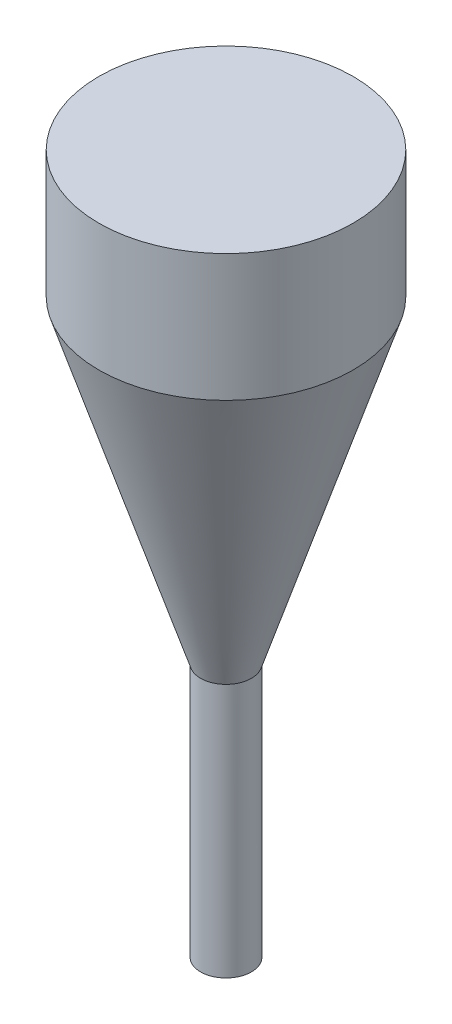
ISO-10303-21;
HEADER;
FILE_DESCRIPTION(('STEP AP214'),'2;1');
FILE_NAME('part.step','',(''),(''),'','','');
FILE_SCHEMA(('AUTOMOTIVE_DESIGN { 1 0 10303 214 1 1 1 1 }'));
ENDSEC;
DATA;
#1=APPLICATION_CONTEXT('core data for automotive mechanical design processes');
#2=APPLICATION_PROTOCOL_DEFINITION('international standard','automotive_design',2000,#1);
#3=PRODUCT_CONTEXT('',#1,'mechanical');
#4=PRODUCT('Part','Part','',(#3));
#5=PRODUCT_RELATED_PRODUCT_CATEGORY('part','',(#4));
#6=PRODUCT_DEFINITION_FORMATION('','',#4);
#7=PRODUCT_DEFINITION_CONTEXT('part definition',#1,'design');
#8=PRODUCT_DEFINITION('design','',#6,#7);
#9=PRODUCT_DEFINITION_SHAPE('','',#8);
#10=(LENGTH_UNIT() NAMED_UNIT(*) SI_UNIT(.MILLI.,.METRE.));
#11=(NAMED_UNIT(*) PLANE_ANGLE_UNIT() SI_UNIT($,.RADIAN.));
#12=(NAMED_UNIT(*) SI_UNIT($,.STERADIAN.) SOLID_ANGLE_UNIT());
#13=UNCERTAINTY_MEASURE_WITH_UNIT(LENGTH_MEASURE(1.E-05),#10,'distance_accuracy_value','');
#14=(GEOMETRIC_REPRESENTATION_CONTEXT(3) GLOBAL_UNCERTAINTY_ASSIGNED_CONTEXT((#13)) GLOBAL_UNIT_ASSIGNED_CONTEXT((#10,
#11,#12)) REPRESENTATION_CONTEXT('',''));
#15=CARTESIAN_POINT('',(0.,0.,0.));
#16=DIRECTION('',(0.,0.,1.));
#17=DIRECTION('',(1.,0.,0.));
#18=AXIS2_PLACEMENT_3D('',#15,#16,#17);
#19=CARTESIAN_POINT('',(0.,35.,0.));
#20=DIRECTION('',(0.,1.,0.));
#21=DIRECTION('',(0.,0.,1.));
#22=AXIS2_PLACEMENT_3D('',#19,#20,#21);
#23=PLANE('',#22);
#24=CARTESIAN_POINT('',(0.,35.,0.));
#25=DIRECTION('',(0.,-1.,0.));
#26=DIRECTION('',(0.,0.,-1.));
#27=AXIS2_PLACEMENT_3D('',#24,#25,#26);
#28=CIRCLE('',#27,10.);
#29=CARTESIAN_POINT('',(0.,35.,-10.));
#30=VERTEX_POINT('',#29);
#31=EDGE_CURVE('E10',#30,#30,#28,.T.);
#32=ORIENTED_EDGE('',*,*,#31,.F.);
#33=EDGE_LOOP('',(#32));
#34=FACE_BOUND('',#33,.T.);
#35=ADVANCED_FACE('F31',(#34),#23,.T.);
#36=CARTESIAN_POINT('',(0.,0.,0.));
#37=DIRECTION('',(0.,-1.,0.));
#38=DIRECTION('',(0.,0.,-1.));
#39=AXIS2_PLACEMENT_3D('',#36,#37,#38);
#40=CYLINDRICAL_SURFACE('',#39,10.);
#41=ORIENTED_EDGE('',*,*,#31,.T.);
#42=EDGE_LOOP('',(#41));
#43=FACE_BOUND('',#42,.T.);
#44=CARTESIAN_POINT('',(0.,25.,0.));
#45=DIRECTION('',(0.,-1.,0.));
#46=DIRECTION('',(0.,0.,-1.));
#47=AXIS2_PLACEMENT_3D('',#44,#45,#46);
#48=CIRCLE('',#47,10.);
#49=CARTESIAN_POINT('',(0.,25.,10.));
#50=VERTEX_POINT('',#49);
#51=EDGE_CURVE('E37',#50,#50,#48,.T.);
#52=ORIENTED_EDGE('',*,*,#51,.F.);
#53=EDGE_LOOP('',(#52));
#54=FACE_BOUND('',#53,.T.);
#55=ADVANCED_FACE('F61',(#43,#54),#40,.T.);
#56=CARTESIAN_POINT('',(0.,0.,0.));
#57=DIRECTION('',(0.,1.,0.));
#58=DIRECTION('',(0.,0.,1.));
#59=AXIS2_PLACEMENT_3D('',#56,#57,#58);
#60=CONICAL_SURFACE('',#59,2.,0.309702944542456);
#61=CARTESIAN_POINT('',(0.,0.,0.));
#62=DIRECTION('',(0.,-1.,0.));
#63=DIRECTION('',(0.,0.,-1.));
#64=AXIS2_PLACEMENT_3D('',#61,#62,#63);
#65=CIRCLE('',#64,2.);
#66=CARTESIAN_POINT('',(0.,0.,2.));
#67=VERTEX_POINT('',#66);
#68=EDGE_CURVE('E41',#67,#67,#65,.T.);
#69=CARTESIAN_POINT('',(0.,25.,10.));
#70=CARTESIAN_POINT('',(0.,24.7395833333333,9.91666666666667));
#71=CARTESIAN_POINT('',(0.,24.4791666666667,9.83333333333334));
#72=CARTESIAN_POINT('',(0.,23.9583333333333,9.66666666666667));
#73=CARTESIAN_POINT('',(0.,23.6979166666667,9.58333333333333));
#74=CARTESIAN_POINT('',(0.,23.1770833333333,9.41666666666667));
#75=CARTESIAN_POINT('',(0.,22.9166666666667,9.33333333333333));
#76=CARTESIAN_POINT('',(0.,22.3958333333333,9.16666666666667));
#77=CARTESIAN_POINT('',(0.,22.1354166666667,9.08333333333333));
#78=CARTESIAN_POINT('',(0.,21.6145833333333,8.91666666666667));
#79=CARTESIAN_POINT('',(0.,21.3541666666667,8.83333333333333));
#80=CARTESIAN_POINT('',(0.,20.8333333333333,8.66666666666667));
#81=CARTESIAN_POINT('',(0.,20.5729166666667,8.58333333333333));
#82=CARTESIAN_POINT('',(0.,20.0520833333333,8.41666666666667));
#83=CARTESIAN_POINT('',(0.,19.7916666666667,8.33333333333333));
#84=CARTESIAN_POINT('',(0.,19.2708333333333,8.16666666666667));
#85=CARTESIAN_POINT('',(0.,19.0104166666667,8.08333333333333));
#86=CARTESIAN_POINT('',(0.,18.4895833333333,7.91666666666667));
#87=CARTESIAN_POINT('',(0.,18.2291666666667,7.83333333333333));
#88=CARTESIAN_POINT('',(0.,17.7083333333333,7.66666666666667));
#89=CARTESIAN_POINT('',(0.,17.4479166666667,7.58333333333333));
#90=CARTESIAN_POINT('',(0.,16.9270833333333,7.41666666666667));
#91=CARTESIAN_POINT('',(0.,16.6666666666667,7.33333333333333));
#92=CARTESIAN_POINT('',(0.,16.1458333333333,7.16666666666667));
#93=CARTESIAN_POINT('',(0.,15.8854166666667,7.08333333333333));
#94=CARTESIAN_POINT('',(0.,15.3645833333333,6.91666666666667));
#95=CARTESIAN_POINT('',(0.,15.1041666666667,6.83333333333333));
#96=CARTESIAN_POINT('',(0.,14.5833333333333,6.66666666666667));
#97=CARTESIAN_POINT('',(0.,14.3229166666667,6.58333333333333));
#98=CARTESIAN_POINT('',(0.,13.8020833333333,6.41666666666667));
#99=CARTESIAN_POINT('',(0.,13.5416666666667,6.33333333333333));
#100=CARTESIAN_POINT('',(0.,13.0208333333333,6.16666666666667));
#101=CARTESIAN_POINT('',(0.,12.7604166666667,6.08333333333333));
#102=CARTESIAN_POINT('',(0.,12.2395833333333,5.91666666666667));
#103=CARTESIAN_POINT('',(0.,11.9791666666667,5.83333333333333));
#104=CARTESIAN_POINT('',(0.,11.4583333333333,5.66666666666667));
#105=CARTESIAN_POINT('',(0.,11.1979166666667,5.58333333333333));
#106=CARTESIAN_POINT('',(0.,10.6770833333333,5.41666666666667));
#107=CARTESIAN_POINT('',(0.,10.4166666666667,5.33333333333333));
#108=CARTESIAN_POINT('',(0.,9.89583333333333,5.16666666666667));
#109=CARTESIAN_POINT('',(0.,9.63541666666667,5.08333333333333));
#110=CARTESIAN_POINT('',(0.,9.11458333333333,4.91666666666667));
#111=CARTESIAN_POINT('',(0.,8.85416666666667,4.83333333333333));
#112=CARTESIAN_POINT('',(0.,8.33333333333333,4.66666666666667));
#113=CARTESIAN_POINT('',(0.,8.07291666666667,4.58333333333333));
#114=CARTESIAN_POINT('',(0.,7.55208333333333,4.41666666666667));
#115=CARTESIAN_POINT('',(0.,7.29166666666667,4.33333333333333));
#116=CARTESIAN_POINT('',(0.,6.77083333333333,4.16666666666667));
#117=CARTESIAN_POINT('',(0.,6.51041666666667,4.08333333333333));
#118=CARTESIAN_POINT('',(0.,5.98958333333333,3.91666666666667));
#119=CARTESIAN_POINT('',(0.,5.72916666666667,3.83333333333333));
#120=CARTESIAN_POINT('',(0.,5.20833333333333,3.66666666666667));
#121=CARTESIAN_POINT('',(0.,4.94791666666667,3.58333333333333));
#122=CARTESIAN_POINT('',(0.,4.42708333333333,3.41666666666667));
#123=CARTESIAN_POINT('',(0.,4.16666666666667,3.33333333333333));
#124=CARTESIAN_POINT('',(0.,3.64583333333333,3.16666666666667));
#125=CARTESIAN_POINT('',(0.,3.38541666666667,3.08333333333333));
#126=CARTESIAN_POINT('',(0.,2.86458333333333,2.91666666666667));
#127=CARTESIAN_POINT('',(0.,2.60416666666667,2.83333333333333));
#128=CARTESIAN_POINT('',(0.,2.08333333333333,2.66666666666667));
#129=CARTESIAN_POINT('',(0.,1.82291666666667,2.58333333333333));
#130=CARTESIAN_POINT('',(0.,1.30208333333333,2.41666666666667));
#131=CARTESIAN_POINT('',(0.,1.04166666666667,2.33333333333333));
#132=CARTESIAN_POINT('',(0.,0.520833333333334,2.16666666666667));
#133=CARTESIAN_POINT('',(0.,0.260416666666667,2.08333333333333));
#134=CARTESIAN_POINT('',(0.,0.,2.));
#135=B_SPLINE_CURVE_WITH_KNOTS('',3,(#69,#70,#71,#72,#73,#74,#75,#76,#77,#78,#79,#80,#81,#82,
#83,#84,#85,#86,#87,#88,#89,#90,#91,#92,#93,#94,#95,#96,#97,#98,#99,#100,#101,#102,#103,#104,
#105,#106,#107,#108,#109,#110,#111,#112,#113,#114,#115,#116,#117,#118,#119,#120,#121,#122,#123,
#124,#125,#126,#127,#128,#129,#130,#131,#132,#133,#134),.UNSPECIFIED.,.F.,.F.,(4,2,2,2,2,2,2,2,
2,2,2,2,2,2,2,2,2,2,2,2,2,2,2,2,2,2,2,2,2,2,2,2,4),(0.,0.820275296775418,1.64055059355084,
2.46082589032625,3.28110118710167,4.10137648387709,4.92165178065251,5.74192707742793,
6.56220237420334,7.38247767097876,8.20275296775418,9.0230282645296,9.84330356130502,
10.6635788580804,11.4838541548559,12.3041294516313,13.1244047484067,13.9446800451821,
14.7649553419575,15.5852306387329,16.4055059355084,17.2257812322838,18.0460565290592,
18.8663318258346,19.68660712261,20.5068824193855,21.3271577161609,22.1474330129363,
22.9677083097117,23.7879836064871,24.6082589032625,25.428534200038,26.2488094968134),.UNSPECIFIED.);
#136=EDGE_CURVE('BSEAM56',#50,#67,#135,.T.);
#137=ORIENTED_EDGE('',*,*,#51,.T.);
#138=ORIENTED_EDGE('',*,*,#68,.F.);
#139=ORIENTED_EDGE('',*,*,#136,.T.);
#140=ORIENTED_EDGE('',*,*,#136,.F.);
#141=EDGE_LOOP('',(#137,#139,#138,#140));
#142=FACE_BOUND('',#141,.T.);
#143=ADVANCED_FACE('F56',(#142),#60,.T.);
#144=CARTESIAN_POINT('',(0.,-20.,0.));
#145=DIRECTION('',(0.,1.,0.));
#146=DIRECTION('',(0.,0.,1.));
#147=AXIS2_PLACEMENT_3D('',#144,#145,#146);
#148=CYLINDRICAL_SURFACE('',#147,2.);
#149=CARTESIAN_POINT('',(0.,-20.,0.));
#150=DIRECTION('',(0.,-1.,0.));
#151=DIRECTION('',(0.,0.,-1.));
#152=AXIS2_PLACEMENT_3D('',#149,#150,#151);
#153=CIRCLE('',#152,2.);
#154=CARTESIAN_POINT('',(0.,-20.,-2.));
#155=VERTEX_POINT('',#154);
#156=EDGE_CURVE('E45',#155,#155,#153,.T.);
#157=ORIENTED_EDGE('',*,*,#156,.F.);
#158=EDGE_LOOP('',(#157));
#159=FACE_BOUND('',#158,.T.);
#160=ORIENTED_EDGE('',*,*,#68,.T.);
#161=EDGE_LOOP('',(#160));
#162=FACE_BOUND('',#161,.T.);
#163=ADVANCED_FACE('F53',(#159,#162),#148,.T.);
#164=CARTESIAN_POINT('',(0.,-20.,0.));
#165=DIRECTION('',(0.,-1.,0.));
#166=DIRECTION('',(0.,0.,-1.));
#167=AXIS2_PLACEMENT_3D('',#164,#165,#166);
#168=PLANE('',#167);
#169=ORIENTED_EDGE('',*,*,#156,.T.);
#170=EDGE_LOOP('',(#169));
#171=FACE_BOUND('',#170,.T.);
#172=ADVANCED_FACE('F51',(#171),#168,.T.);
#173=CLOSED_SHELL('',(#35,#55,#143,#163,#172));
#174=MANIFOLD_SOLID_BREP('B2',#173);
#175=ADVANCED_BREP_SHAPE_REPRESENTATION('',(#18,#174),#14);
#176=SHAPE_DEFINITION_REPRESENTATION(#9,#175);
ENDSEC;
END-ISO-10303-21;
